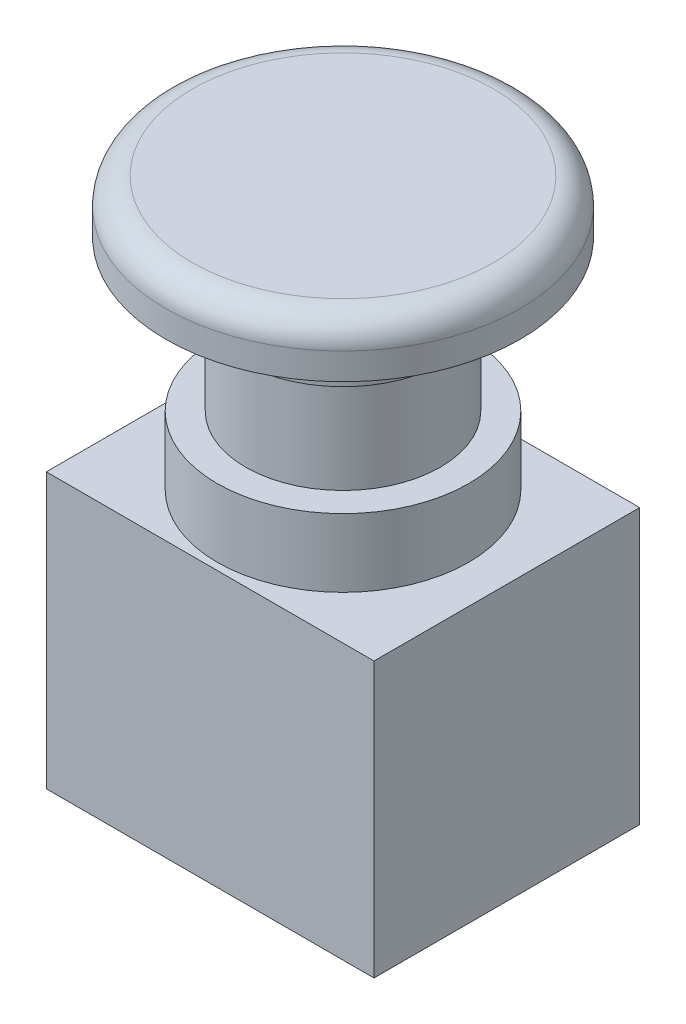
from build123d import *

# Parameters (mm, degrees)
CROQUIS1_W              = 37
CROQUIS1_H              = 30
SALIENTE_EXTRUIR1_DEPTH = 31
CROQUIS2_R              = 14.2
SALIENTE_EXTRUIR2_DEPTH = 7.7
CROQUIS3_R              = 11
SALIENTE_EXTRUIR3_DEPTH = 10.5
CROQUIS4_R              = 11.5
SALIENTE_EXTRUIR4_DEPTH = 6.5
CROQUIS5_R              = 20
SALIENTE_EXTRUIR5_DEPTH = 6
REDONDEO1_R             = 3


with BuildPart() as part:
    # Croquis1 → Saliente-Extruir1 (new body)
    with BuildSketch(Plane(origin=(0, 0, 0), x_dir=(1, 0, 0), z_dir=(0, 1, 0))):
        Rectangle(CROQUIS1_W, CROQUIS1_H)
    extrude(amount=SALIENTE_EXTRUIR1_DEPTH)

    # Croquis2 → Saliente-Extruir2 (add)
    with BuildSketch(Plane(origin=(0, 31, 0), x_dir=(1, 0, 0), z_dir=(0, 1, 0))):
        with Locations(Location((0, 0, 0), (0, 0, 90))):
            Circle(CROQUIS2_R)
    extrude(amount=SALIENTE_EXTRUIR2_DEPTH)

    # Croquis3 → Saliente-Extruir3 (add)
    with BuildSketch(Plane(origin=(0, 38.7, 0), x_dir=(1, 0, 0), z_dir=(0, 1, 0))):
        with Locations(Location((0, 0, 0), (0, 0, 90))):
            Circle(CROQUIS3_R)
    extrude(amount=SALIENTE_EXTRUIR3_DEPTH)

    # Croquis4 → Saliente-Extruir4 (add)
    with BuildSketch(Plane(origin=(0, 49.2, 0), x_dir=(1, 0, 0), z_dir=(0, 1, 0))):
        with Locations(Location((0, 0, 0), (0, 0, 90))):
            Circle(CROQUIS4_R)
    extrude(amount=SALIENTE_EXTRUIR4_DEPTH)

    # Croquis5 → Saliente-Extruir5 (add)
    with BuildSketch(Plane(origin=(0, 55.7, 0), x_dir=(1, 0, 0), z_dir=(0, 1, 0))):
        with Locations(Location((0, 0, 0), (0, 0, 270))):
            Circle(CROQUIS5_R)
    extrude(amount=SALIENTE_EXTRUIR5_DEPTH)

    # Redondeo1
    redondeo1_edges = [part.edges().sort_by_distance(p)[0] for p in [
        (0, 61.7, -20),
    ]]
    fillet(redondeo1_edges, radius=REDONDEO1_R)


solid = part.part
